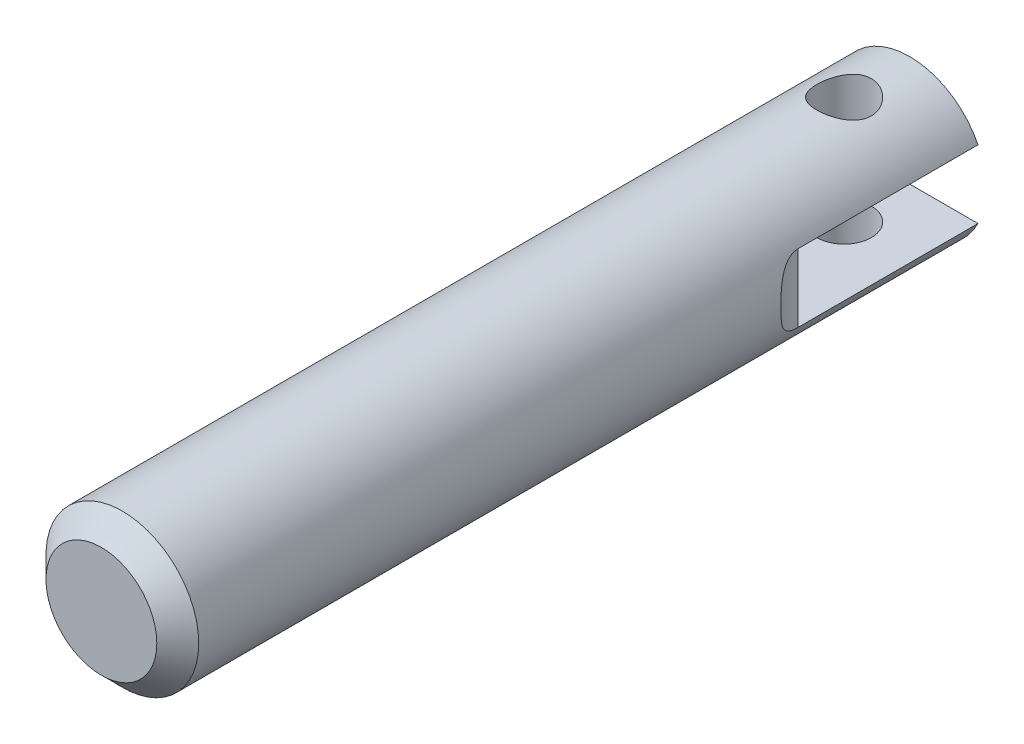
from build123d import *

# Parameters (mm, degrees)
SKETCH1_R           = 5.5499
BOSS_EXTRUDE1_DEPTH = 58.7375
CHAMFER1_SIZE       = 1.524
SKETCH2_W           = 12.7
SKETCH2_H           = 13.081
CUT_EXTRUDE1_DEPTH  = 2.4765
SKETCH3_R           = 3.175
CUT_EXTRUDE2_DEPTH  = 60.259570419
SKETCH4_R           = 1.9812
CUT_EXTRUDE3_DEPTH  = 25.4


with BuildPart() as part:
    # Sketch1 → Boss-Extrude1 (new body)
    with BuildSketch(Plane.XY):
        Circle(SKETCH1_R)
    extrude(amount=-BOSS_EXTRUDE1_DEPTH)

    # Chamfer1
    chamfer1_edges = [part.edges().sort_by_distance(p)[0] for p in [
        (-5.5499, 0, 0),
    ]]
    chamfer(chamfer1_edges, length=CHAMFER1_SIZE)

    # Sketch2 → Cut-Extrude1 (cut, symmetric)
    with BuildSketch(Plane(origin=(0, 0, 0), x_dir=(1, 0, 0), z_dir=(0, 1, 0))):
        with Locations((0, 52.197)):
            Rectangle(SKETCH2_W, SKETCH2_H)
    extrude(amount=CUT_EXTRUDE1_DEPTH, both=True, mode=Mode.SUBTRACT)

    # Sketch3 → Cut-Extrude2 (cut, symmetric)
    with BuildSketch(Plane(origin=(0, 0, 0), x_dir=(1, 0, 0), z_dir=(0, 1, 0))):
        with Locations((8.14172304, 45.6565)):
            Circle(SKETCH3_R)
    cut_extrude2 = extrude(amount=CUT_EXTRUDE2_DEPTH, both=True, mode=Mode.SUBTRACT)

    # Mirror1: Cut-Extrude2 across plane
    add(cut_extrude2.mirror(Plane(origin=(0, 0, 0), x_dir=(0, 0, 1), z_dir=(1, 0, 0))), mode=Mode.SUBTRACT)

    # Sketch4 → Cut-Extrude3 (cut, symmetric)
    with BuildSketch(Plane(origin=(0, 0, 0), x_dir=(1, 0, 0), z_dir=(0, 1, 0))):
        with Locations(Location((0, 53.975, 0), (0, 0, 270))):
            Circle(SKETCH4_R)
    extrude(amount=CUT_EXTRUDE3_DEPTH, both=True, mode=Mode.SUBTRACT)


solid = part.part
